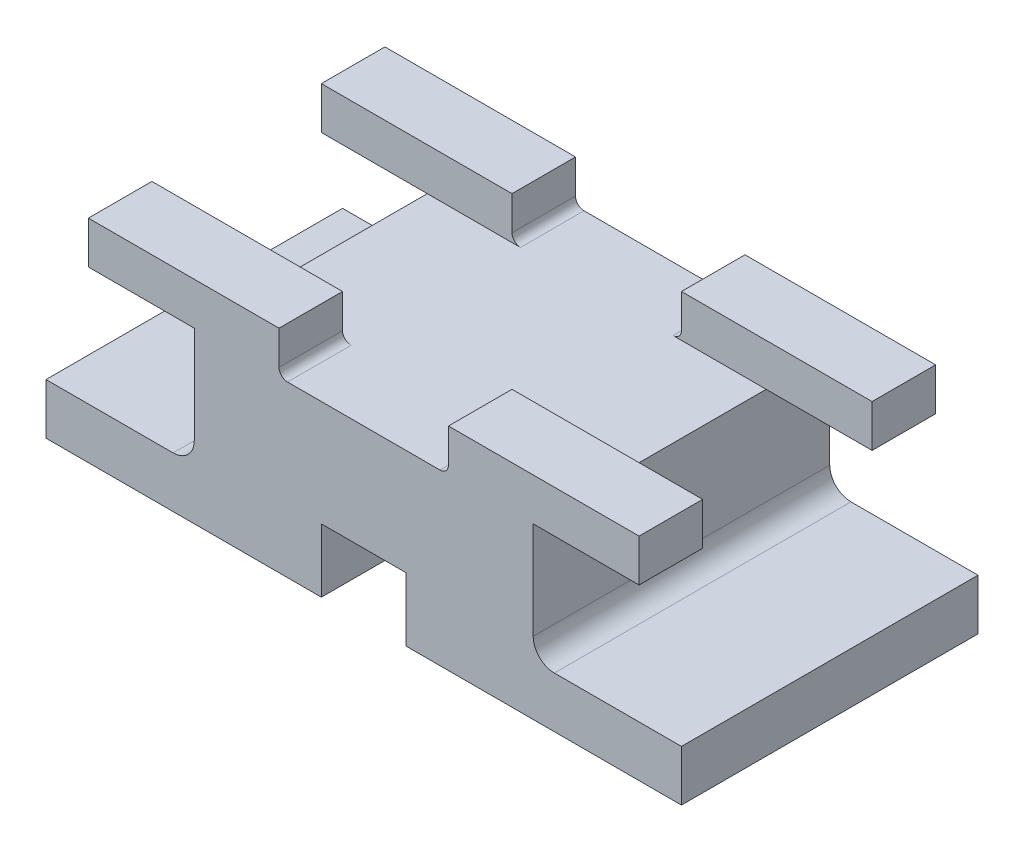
ISO-10303-21;
HEADER;
FILE_DESCRIPTION(('STEP AP214'),'2;1');
FILE_NAME('part.step','',(''),(''),'','','');
FILE_SCHEMA(('AUTOMOTIVE_DESIGN { 1 0 10303 214 1 1 1 1 }'));
ENDSEC;
DATA;
#1=APPLICATION_CONTEXT('core data for automotive mechanical design processes');
#2=APPLICATION_PROTOCOL_DEFINITION('international standard','automotive_design',2000,#1);
#3=PRODUCT_CONTEXT('',#1,'mechanical');
#4=PRODUCT('Part','Part','',(#3));
#5=PRODUCT_RELATED_PRODUCT_CATEGORY('part','',(#4));
#6=PRODUCT_DEFINITION_FORMATION('','',#4);
#7=PRODUCT_DEFINITION_CONTEXT('part definition',#1,'design');
#8=PRODUCT_DEFINITION('design','',#6,#7);
#9=PRODUCT_DEFINITION_SHAPE('','',#8);
#10=(LENGTH_UNIT() NAMED_UNIT(*) SI_UNIT(.MILLI.,.METRE.));
#11=(NAMED_UNIT(*) PLANE_ANGLE_UNIT() SI_UNIT($,.RADIAN.));
#12=(NAMED_UNIT(*) SI_UNIT($,.STERADIAN.) SOLID_ANGLE_UNIT());
#13=UNCERTAINTY_MEASURE_WITH_UNIT(LENGTH_MEASURE(1.E-05),#10,'distance_accuracy_value','');
#14=(GEOMETRIC_REPRESENTATION_CONTEXT(3) GLOBAL_UNCERTAINTY_ASSIGNED_CONTEXT((#13)) GLOBAL_UNIT_ASSIGNED_CONTEXT((#10,
#11,#12)) REPRESENTATION_CONTEXT('',''));
#15=CARTESIAN_POINT('',(0.,0.,0.));
#16=DIRECTION('',(0.,0.,1.));
#17=DIRECTION('',(1.,0.,0.));
#18=AXIS2_PLACEMENT_3D('',#15,#16,#17);
#19=CARTESIAN_POINT('',(40.,40.,35.));
#20=DIRECTION('',(0.,1.,0.));
#21=DIRECTION('',(0.,0.,1.));
#22=AXIS2_PLACEMENT_3D('',#19,#20,#21);
#23=PLANE('',#22);
#24=DIRECTION('',(0.,0.,-1.));
#25=VECTOR('',#24,1.);
#26=CARTESIAN_POINT('',(40.,40.,35.));
#27=LINE('',#26,#25);
#28=CARTESIAN_POINT('',(40.,40.,35.));
#29=VERTEX_POINT('',#28);
#30=CARTESIAN_POINT('',(40.,40.,20.));
#31=VERTEX_POINT('',#30);
#32=EDGE_CURVE('E305',#29,#31,#27,.T.);
#33=ORIENTED_EDGE('',*,*,#32,.T.);
#34=DIRECTION('',(-1.,0.,0.));
#35=VECTOR('',#34,1.);
#36=CARTESIAN_POINT('',(-65.,40.,20.));
#37=LINE('',#36,#35);
#38=CARTESIAN_POINT('',(65.,40.,20.));
#39=VERTEX_POINT('',#38);
#40=EDGE_CURVE('E590',#39,#31,#37,.T.);
#41=ORIENTED_EDGE('',*,*,#40,.F.);
#42=DIRECTION('',(0.,0.,-1.));
#43=VECTOR('',#42,1.);
#44=CARTESIAN_POINT('',(65.,40.,35.));
#45=LINE('',#44,#43);
#46=CARTESIAN_POINT('',(65.,40.,35.));
#47=VERTEX_POINT('',#46);
#48=EDGE_CURVE('E301',#47,#39,#45,.T.);
#49=ORIENTED_EDGE('',*,*,#48,.F.);
#50=DIRECTION('',(1.,0.,0.));
#51=VECTOR('',#50,1.);
#52=CARTESIAN_POINT('',(40.,40.,35.));
#53=LINE('',#52,#51);
#54=EDGE_CURVE('E506',#29,#47,#53,.T.);
#55=ORIENTED_EDGE('',*,*,#54,.F.);
#56=EDGE_LOOP('',(#33,#41,#49,#55));
#57=FACE_BOUND('',#56,.T.);
#58=ADVANCED_FACE('F33',(#57),#23,.F.);
#59=CARTESIAN_POINT('',(65.,40.,35.));
#60=DIRECTION('',(-1.,0.,0.));
#61=DIRECTION('',(0.,0.,1.));
#62=AXIS2_PLACEMENT_3D('',#59,#60,#61);
#63=PLANE('',#62);
#64=ORIENTED_EDGE('',*,*,#48,.T.);
#65=DIRECTION('',(0.,1.,0.));
#66=VECTOR('',#65,1.);
#67=CARTESIAN_POINT('',(65.,-96.0147050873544,20.));
#68=LINE('',#67,#66);
#69=CARTESIAN_POINT('',(65.,50.,20.));
#70=VERTEX_POINT('',#69);
#71=EDGE_CURVE('E578',#39,#70,#68,.T.);
#72=ORIENTED_EDGE('',*,*,#71,.T.);
#73=DIRECTION('',(0.,0.,-1.));
#74=VECTOR('',#73,1.);
#75=CARTESIAN_POINT('',(65.,50.,35.));
#76=LINE('',#75,#74);
#77=CARTESIAN_POINT('',(65.,50.,35.));
#78=VERTEX_POINT('',#77);
#79=EDGE_CURVE('E292',#78,#70,#76,.T.);
#80=ORIENTED_EDGE('',*,*,#79,.F.);
#81=DIRECTION('',(0.,1.,0.));
#82=VECTOR('',#81,1.);
#83=CARTESIAN_POINT('',(65.,40.,35.));
#84=LINE('',#83,#82);
#85=EDGE_CURVE('E508',#47,#78,#84,.T.);
#86=ORIENTED_EDGE('',*,*,#85,.F.);
#87=EDGE_LOOP('',(#64,#72,#80,#86));
#88=FACE_BOUND('',#87,.T.);
#89=ADVANCED_FACE('F629',(#88),#63,.F.);
#90=CARTESIAN_POINT('',(65.,50.,35.));
#91=DIRECTION('',(0.,-1.,0.));
#92=DIRECTION('',(1.,0.,0.));
#93=AXIS2_PLACEMENT_3D('',#90,#91,#92);
#94=PLANE('',#93);
#95=ORIENTED_EDGE('',*,*,#79,.T.);
#96=DIRECTION('',(1.,0.,0.));
#97=VECTOR('',#96,1.);
#98=CARTESIAN_POINT('',(-65.,50.,20.));
#99=LINE('',#98,#97);
#100=CARTESIAN_POINT('',(20.,50.,20.));
#101=VERTEX_POINT('',#100);
#102=EDGE_CURVE('E285',#101,#70,#99,.T.);
#103=ORIENTED_EDGE('',*,*,#102,.F.);
#104=DIRECTION('',(0.,0.,-1.));
#105=VECTOR('',#104,1.);
#106=CARTESIAN_POINT('',(20.,50.,35.));
#107=LINE('',#106,#105);
#108=CARTESIAN_POINT('',(20.,50.,35.));
#109=VERTEX_POINT('',#108);
#110=EDGE_CURVE('E293',#109,#101,#107,.T.);
#111=ORIENTED_EDGE('',*,*,#110,.F.);
#112=DIRECTION('',(-1.,0.,0.));
#113=VECTOR('',#112,1.);
#114=CARTESIAN_POINT('',(65.,50.,35.));
#115=LINE('',#114,#113);
#116=EDGE_CURVE('E510',#78,#109,#115,.T.);
#117=ORIENTED_EDGE('',*,*,#116,.F.);
#118=EDGE_LOOP('',(#95,#103,#111,#117));
#119=FACE_BOUND('',#118,.T.);
#120=ADVANCED_FACE('F635',(#119),#94,.F.);
#121=CARTESIAN_POINT('',(20.,50.,35.));
#122=DIRECTION('',(1.,0.,0.));
#123=DIRECTION('',(0.,1.,0.));
#124=AXIS2_PLACEMENT_3D('',#121,#122,#123);
#125=PLANE('',#124);
#126=ORIENTED_EDGE('',*,*,#110,.T.);
#127=DIRECTION('',(0.,-1.,0.));
#128=VECTOR('',#127,1.);
#129=CARTESIAN_POINT('',(20.,50.,20.));
#130=LINE('',#129,#128);
#131=CARTESIAN_POINT('',(20.,42.,20.));
#132=VERTEX_POINT('',#131);
#133=EDGE_CURVE('E486',#101,#132,#130,.T.);
#134=ORIENTED_EDGE('',*,*,#133,.T.);
#135=DIRECTION('',(0.,0.,-1.));
#136=VECTOR('',#135,1.);
#137=CARTESIAN_POINT('',(20.,42.,35.));
#138=LINE('',#137,#136);
#139=CARTESIAN_POINT('',(20.,42.,35.));
#140=VERTEX_POINT('',#139);
#141=EDGE_CURVE('E440',#140,#132,#138,.T.);
#142=ORIENTED_EDGE('',*,*,#141,.F.);
#143=DIRECTION('',(0.,-1.,0.));
#144=VECTOR('',#143,1.);
#145=CARTESIAN_POINT('',(20.,50.,35.));
#146=LINE('',#145,#144);
#147=EDGE_CURVE('E512',#109,#140,#146,.T.);
#148=ORIENTED_EDGE('',*,*,#147,.F.);
#149=EDGE_LOOP('',(#126,#134,#142,#148));
#150=FACE_BOUND('',#149,.T.);
#151=ADVANCED_FACE('F741',(#150),#125,.F.);
#152=CARTESIAN_POINT('',(18.,42.,35.));
#153=DIRECTION('',(0.,0.,-1.));
#154=DIRECTION('',(-1.,0.,0.));
#155=AXIS2_PLACEMENT_3D('',#152,#153,#154);
#156=CYLINDRICAL_SURFACE('',#155,2.);
#157=ORIENTED_EDGE('',*,*,#141,.T.);
#158=CARTESIAN_POINT('',(18.,42.,20.));
#159=DIRECTION('',(0.,0.,1.));
#160=DIRECTION('',(1.,0.,0.));
#161=AXIS2_PLACEMENT_3D('',#158,#159,#160);
#162=CIRCLE('',#161,2.);
#163=CARTESIAN_POINT('',(18.,40.,20.));
#164=VERTEX_POINT('',#163);
#165=EDGE_CURVE('E484',#132,#164,#162,.F.);
#166=ORIENTED_EDGE('',*,*,#165,.T.);
#167=DIRECTION('',(0.,0.,-1.));
#168=VECTOR('',#167,1.);
#169=CARTESIAN_POINT('',(18.,40.,35.));
#170=LINE('',#169,#168);
#171=CARTESIAN_POINT('',(18.,40.,35.));
#172=VERTEX_POINT('',#171);
#173=EDGE_CURVE('E437',#172,#164,#170,.T.);
#174=ORIENTED_EDGE('',*,*,#173,.F.);
#175=CARTESIAN_POINT('',(18.,42.,35.));
#176=DIRECTION('',(0.,0.,-1.));
#177=DIRECTION('',(-1.,0.,0.));
#178=AXIS2_PLACEMENT_3D('',#175,#176,#177);
#179=CIRCLE('',#178,2.);
#180=EDGE_CURVE('E514',#140,#172,#179,.T.);
#181=ORIENTED_EDGE('',*,*,#180,.F.);
#182=EDGE_LOOP('',(#157,#166,#174,#181));
#183=FACE_BOUND('',#182,.T.);
#184=ADVANCED_FACE('F751',(#183),#156,.F.);
#185=CARTESIAN_POINT('',(-18.,42.,35.));
#186=DIRECTION('',(0.,0.,-1.));
#187=DIRECTION('',(-1.,0.,0.));
#188=AXIS2_PLACEMENT_3D('',#185,#186,#187);
#189=CYLINDRICAL_SURFACE('',#188,2.);
#190=DIRECTION('',(0.,0.,-1.));
#191=VECTOR('',#190,1.);
#192=CARTESIAN_POINT('',(-18.,40.,35.));
#193=LINE('',#192,#191);
#194=CARTESIAN_POINT('',(-18.,40.,35.));
#195=VERTEX_POINT('',#194);
#196=CARTESIAN_POINT('',(-18.,40.,20.));
#197=VERTEX_POINT('',#196);
#198=EDGE_CURVE('E433',#195,#197,#193,.T.);
#199=ORIENTED_EDGE('',*,*,#198,.T.);
#200=CARTESIAN_POINT('',(-18.,42.,20.));
#201=DIRECTION('',(0.,0.,1.));
#202=DIRECTION('',(1.,0.,0.));
#203=AXIS2_PLACEMENT_3D('',#200,#201,#202);
#204=CIRCLE('',#203,2.);
#205=CARTESIAN_POINT('',(-20.,42.,20.));
#206=VERTEX_POINT('',#205);
#207=EDGE_CURVE('E481',#197,#206,#204,.F.);
#208=ORIENTED_EDGE('',*,*,#207,.T.);
#209=DIRECTION('',(0.,0.,-1.));
#210=VECTOR('',#209,1.);
#211=CARTESIAN_POINT('',(-20.,42.,35.));
#212=LINE('',#211,#210);
#213=CARTESIAN_POINT('',(-20.,42.,35.));
#214=VERTEX_POINT('',#213);
#215=EDGE_CURVE('E429',#214,#206,#212,.T.);
#216=ORIENTED_EDGE('',*,*,#215,.F.);
#217=CARTESIAN_POINT('',(-18.,42.,35.));
#218=DIRECTION('',(0.,0.,-1.));
#219=DIRECTION('',(1.,0.,0.));
#220=AXIS2_PLACEMENT_3D('',#217,#218,#219);
#221=CIRCLE('',#220,2.);
#222=EDGE_CURVE('E518',#195,#214,#221,.T.);
#223=ORIENTED_EDGE('',*,*,#222,.F.);
#224=EDGE_LOOP('',(#199,#208,#216,#223));
#225=FACE_BOUND('',#224,.T.);
#226=ADVANCED_FACE('F761',(#225),#189,.F.);
#227=CARTESIAN_POINT('',(-20.,50.,35.));
#228=DIRECTION('',(-1.,0.,0.));
#229=DIRECTION('',(0.,-1.,0.));
#230=AXIS2_PLACEMENT_3D('',#227,#228,#229);
#231=PLANE('',#230);
#232=ORIENTED_EDGE('',*,*,#215,.T.);
#233=DIRECTION('',(0.,1.,0.));
#234=VECTOR('',#233,1.);
#235=CARTESIAN_POINT('',(-20.,50.,20.));
#236=LINE('',#235,#234);
#237=CARTESIAN_POINT('',(-20.,50.,20.));
#238=VERTEX_POINT('',#237);
#239=EDGE_CURVE('E478',#206,#238,#236,.T.);
#240=ORIENTED_EDGE('',*,*,#239,.T.);
#241=DIRECTION('',(0.,0.,-1.));
#242=VECTOR('',#241,1.);
#243=CARTESIAN_POINT('',(-20.,50.,35.));
#244=LINE('',#243,#242);
#245=CARTESIAN_POINT('',(-20.,50.,35.));
#246=VERTEX_POINT('',#245);
#247=EDGE_CURVE('E425',#246,#238,#244,.T.);
#248=ORIENTED_EDGE('',*,*,#247,.F.);
#249=DIRECTION('',(0.,1.,0.));
#250=VECTOR('',#249,1.);
#251=CARTESIAN_POINT('',(-20.,50.,35.));
#252=LINE('',#251,#250);
#253=EDGE_CURVE('E520',#214,#246,#252,.T.);
#254=ORIENTED_EDGE('',*,*,#253,.F.);
#255=EDGE_LOOP('',(#232,#240,#248,#254));
#256=FACE_BOUND('',#255,.T.);
#257=ADVANCED_FACE('F770',(#256),#231,.F.);
#258=CARTESIAN_POINT('',(-65.,50.,35.));
#259=DIRECTION('',(0.,-1.,0.));
#260=DIRECTION('',(1.,0.,0.));
#261=AXIS2_PLACEMENT_3D('',#258,#259,#260);
#262=PLANE('',#261);
#263=ORIENTED_EDGE('',*,*,#247,.T.);
#264=CARTESIAN_POINT('',(-65.,50.,20.));
#265=VERTEX_POINT('',#264);
#266=EDGE_CURVE('E276',#265,#238,#99,.T.);
#267=ORIENTED_EDGE('',*,*,#266,.F.);
#268=DIRECTION('',(0.,0.,-1.));
#269=VECTOR('',#268,1.);
#270=CARTESIAN_POINT('',(-65.,50.,35.));
#271=LINE('',#270,#269);
#272=CARTESIAN_POINT('',(-65.,50.,35.));
#273=VERTEX_POINT('',#272);
#274=EDGE_CURVE('E421',#273,#265,#271,.T.);
#275=ORIENTED_EDGE('',*,*,#274,.F.);
#276=DIRECTION('',(-1.,0.,0.));
#277=VECTOR('',#276,1.);
#278=CARTESIAN_POINT('',(-65.,50.,35.));
#279=LINE('',#278,#277);
#280=EDGE_CURVE('E522',#246,#273,#279,.T.);
#281=ORIENTED_EDGE('',*,*,#280,.F.);
#282=EDGE_LOOP('',(#263,#267,#275,#281));
#283=FACE_BOUND('',#282,.T.);
#284=ADVANCED_FACE('F780',(#283),#262,.F.);
#285=CARTESIAN_POINT('',(-65.,40.,35.));
#286=DIRECTION('',(1.,0.,0.));
#287=DIRECTION('',(0.,0.,-1.));
#288=AXIS2_PLACEMENT_3D('',#285,#286,#287);
#289=PLANE('',#288);
#290=ORIENTED_EDGE('',*,*,#274,.T.);
#291=DIRECTION('',(0.,1.,0.));
#292=VECTOR('',#291,1.);
#293=CARTESIAN_POINT('',(-65.,-96.0147050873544,20.));
#294=LINE('',#293,#292);
#295=CARTESIAN_POINT('',(-65.,40.,20.));
#296=VERTEX_POINT('',#295);
#297=EDGE_CURVE('E576',#296,#265,#294,.T.);
#298=ORIENTED_EDGE('',*,*,#297,.F.);
#299=DIRECTION('',(0.,0.,-1.));
#300=VECTOR('',#299,1.);
#301=CARTESIAN_POINT('',(-65.,40.,35.));
#302=LINE('',#301,#300);
#303=CARTESIAN_POINT('',(-65.,40.,35.));
#304=VERTEX_POINT('',#303);
#305=EDGE_CURVE('E417',#304,#296,#302,.T.);
#306=ORIENTED_EDGE('',*,*,#305,.F.);
#307=DIRECTION('',(0.,-1.,0.));
#308=VECTOR('',#307,1.);
#309=CARTESIAN_POINT('',(-65.,40.,35.));
#310=LINE('',#309,#308);
#311=EDGE_CURVE('E524',#273,#304,#310,.T.);
#312=ORIENTED_EDGE('',*,*,#311,.F.);
#313=EDGE_LOOP('',(#290,#298,#306,#312));
#314=FACE_BOUND('',#313,.T.);
#315=ADVANCED_FACE('F790',(#314),#289,.F.);
#316=CARTESIAN_POINT('',(-40.,40.,35.));
#317=DIRECTION('',(0.,1.,0.));
#318=DIRECTION('',(0.,0.,1.));
#319=AXIS2_PLACEMENT_3D('',#316,#317,#318);
#320=PLANE('',#319);
#321=ORIENTED_EDGE('',*,*,#305,.T.);
#322=CARTESIAN_POINT('',(-40.,40.,20.));
#323=VERTEX_POINT('',#322);
#324=EDGE_CURVE('E937',#323,#296,#37,.T.);
#325=ORIENTED_EDGE('',*,*,#324,.F.);
#326=DIRECTION('',(0.,0.,-1.));
#327=VECTOR('',#326,1.);
#328=CARTESIAN_POINT('',(-40.,40.,35.));
#329=LINE('',#328,#327);
#330=CARTESIAN_POINT('',(-40.,40.,35.));
#331=VERTEX_POINT('',#330);
#332=EDGE_CURVE('E412',#331,#323,#329,.T.);
#333=ORIENTED_EDGE('',*,*,#332,.F.);
#334=DIRECTION('',(1.,0.,0.));
#335=VECTOR('',#334,1.);
#336=CARTESIAN_POINT('',(-40.,40.,35.));
#337=LINE('',#336,#335);
#338=EDGE_CURVE('E526',#304,#331,#337,.T.);
#339=ORIENTED_EDGE('',*,*,#338,.F.);
#340=EDGE_LOOP('',(#321,#325,#333,#339));
#341=FACE_BOUND('',#340,.T.);
#342=ADVANCED_FACE('F627',(#341),#320,.F.);
#343=CARTESIAN_POINT('',(-75.,0.,35.));
#344=DIRECTION('',(0.,1.,0.));
#345=DIRECTION('',(0.,0.,1.));
#346=AXIS2_PLACEMENT_3D('',#343,#344,#345);
#347=PLANE('',#346);
#348=DIRECTION('',(1.,0.,0.));
#349=VECTOR('',#348,1.);
#350=CARTESIAN_POINT('',(-75.,0.,-35.));
#351=LINE('',#350,#349);
#352=CARTESIAN_POINT('',(-75.,0.,-35.));
#353=VERTEX_POINT('',#352);
#354=CARTESIAN_POINT('',(-10.,0.,-35.));
#355=VERTEX_POINT('',#354);
#356=EDGE_CURVE('E345',#353,#355,#351,.T.);
#357=ORIENTED_EDGE('',*,*,#356,.T.);
#358=DIRECTION('',(0.,0.,-1.));
#359=VECTOR('',#358,1.);
#360=CARTESIAN_POINT('',(-10.,0.,35.));
#361=LINE('',#360,#359);
#362=CARTESIAN_POINT('',(-10.,0.,35.));
#363=VERTEX_POINT('',#362);
#364=EDGE_CURVE('E11',#363,#355,#361,.T.);
#365=ORIENTED_EDGE('',*,*,#364,.F.);
#366=DIRECTION('',(1.,0.,0.));
#367=VECTOR('',#366,1.);
#368=CARTESIAN_POINT('',(-75.,0.,35.));
#369=LINE('',#368,#367);
#370=CARTESIAN_POINT('',(-75.,0.,35.));
#371=VERTEX_POINT('',#370);
#372=EDGE_CURVE('E397',#371,#363,#369,.T.);
#373=ORIENTED_EDGE('',*,*,#372,.F.);
#374=DIRECTION('',(0.,0.,-1.));
#375=VECTOR('',#374,1.);
#376=CARTESIAN_POINT('',(-75.,0.,35.));
#377=LINE('',#376,#375);
#378=EDGE_CURVE('E398',#371,#353,#377,.T.);
#379=ORIENTED_EDGE('',*,*,#378,.T.);
#380=EDGE_LOOP('',(#357,#365,#373,#379));
#381=FACE_BOUND('',#380,.T.);
#382=ADVANCED_FACE('F35',(#381),#347,.F.);
#383=CARTESIAN_POINT('',(-10.,0.,35.));
#384=DIRECTION('',(-1.,0.,0.));
#385=DIRECTION('',(0.,0.,1.));
#386=AXIS2_PLACEMENT_3D('',#383,#384,#385);
#387=PLANE('',#386);
#388=DIRECTION('',(0.,1.,0.));
#389=VECTOR('',#388,1.);
#390=CARTESIAN_POINT('',(-10.,0.,-35.));
#391=LINE('',#390,#389);
#392=CARTESIAN_POINT('',(-10.,15.,-35.));
#393=VERTEX_POINT('',#392);
#394=EDGE_CURVE('E339',#355,#393,#391,.T.);
#395=ORIENTED_EDGE('',*,*,#394,.T.);
#396=DIRECTION('',(0.,0.,-1.));
#397=VECTOR('',#396,1.);
#398=CARTESIAN_POINT('',(-10.,15.,35.));
#399=LINE('',#398,#397);
#400=CARTESIAN_POINT('',(-10.,15.,35.));
#401=VERTEX_POINT('',#400);
#402=EDGE_CURVE('E41',#401,#393,#399,.T.);
#403=ORIENTED_EDGE('',*,*,#402,.F.);
#404=DIRECTION('',(0.,1.,0.));
#405=VECTOR('',#404,1.);
#406=CARTESIAN_POINT('',(-10.,0.,35.));
#407=LINE('',#406,#405);
#408=EDGE_CURVE('E491',#363,#401,#407,.T.);
#409=ORIENTED_EDGE('',*,*,#408,.F.);
#410=ORIENTED_EDGE('',*,*,#364,.T.);
#411=EDGE_LOOP('',(#395,#403,#409,#410));
#412=FACE_BOUND('',#411,.T.);
#413=ADVANCED_FACE('F620',(#412),#387,.F.);
#414=CARTESIAN_POINT('',(-10.,15.,35.));
#415=DIRECTION('',(0.,1.,0.));
#416=DIRECTION('',(0.,0.,1.));
#417=AXIS2_PLACEMENT_3D('',#414,#415,#416);
#418=PLANE('',#417);
#419=DIRECTION('',(1.,0.,0.));
#420=VECTOR('',#419,1.);
#421=CARTESIAN_POINT('',(-10.,15.,-35.));
#422=LINE('',#421,#420);
#423=CARTESIAN_POINT('',(10.,15.,-35.));
#424=VERTEX_POINT('',#423);
#425=EDGE_CURVE('E332',#393,#424,#422,.T.);
#426=ORIENTED_EDGE('',*,*,#425,.T.);
#427=DIRECTION('',(0.,0.,-1.));
#428=VECTOR('',#427,1.);
#429=CARTESIAN_POINT('',(10.,15.,35.));
#430=LINE('',#429,#428);
#431=CARTESIAN_POINT('',(10.,15.,35.));
#432=VERTEX_POINT('',#431);
#433=EDGE_CURVE('E323',#432,#424,#430,.T.);
#434=ORIENTED_EDGE('',*,*,#433,.F.);
#435=DIRECTION('',(1.,0.,0.));
#436=VECTOR('',#435,1.);
#437=CARTESIAN_POINT('',(-10.,15.,35.));
#438=LINE('',#437,#436);
#439=EDGE_CURVE('E333',#401,#432,#438,.T.);
#440=ORIENTED_EDGE('',*,*,#439,.F.);
#441=ORIENTED_EDGE('',*,*,#402,.T.);
#442=EDGE_LOOP('',(#426,#434,#440,#441));
#443=FACE_BOUND('',#442,.T.);
#444=ADVANCED_FACE('F330',(#443),#418,.F.);
#445=CARTESIAN_POINT('',(10.,0.,35.));
#446=DIRECTION('',(1.,0.,0.));
#447=DIRECTION('',(0.,0.,-1.));
#448=AXIS2_PLACEMENT_3D('',#445,#446,#447);
#449=PLANE('',#448);
#450=DIRECTION('',(0.,-1.,0.));
#451=VECTOR('',#450,1.);
#452=CARTESIAN_POINT('',(10.,0.,-35.));
#453=LINE('',#452,#451);
#454=CARTESIAN_POINT('',(10.,0.,-35.));
#455=VERTEX_POINT('',#454);
#456=EDGE_CURVE('E341',#424,#455,#453,.T.);
#457=ORIENTED_EDGE('',*,*,#456,.T.);
#458=DIRECTION('',(0.,0.,-1.));
#459=VECTOR('',#458,1.);
#460=CARTESIAN_POINT('',(10.,0.,35.));
#461=LINE('',#460,#459);
#462=CARTESIAN_POINT('',(10.,0.,35.));
#463=VERTEX_POINT('',#462);
#464=EDGE_CURVE('E320',#463,#455,#461,.T.);
#465=ORIENTED_EDGE('',*,*,#464,.F.);
#466=DIRECTION('',(0.,-1.,0.));
#467=VECTOR('',#466,1.);
#468=CARTESIAN_POINT('',(10.,0.,35.));
#469=LINE('',#468,#467);
#470=EDGE_CURVE('E494',#432,#463,#469,.T.);
#471=ORIENTED_EDGE('',*,*,#470,.F.);
#472=ORIENTED_EDGE('',*,*,#433,.T.);
#473=EDGE_LOOP('',(#457,#465,#471,#472));
#474=FACE_BOUND('',#473,.T.);
#475=ADVANCED_FACE('F617',(#474),#449,.F.);
#476=CARTESIAN_POINT('',(75.,0.,35.));
#477=DIRECTION('',(0.,1.,0.));
#478=DIRECTION('',(0.,0.,1.));
#479=AXIS2_PLACEMENT_3D('',#476,#477,#478);
#480=PLANE('',#479);
#481=DIRECTION('',(1.,0.,0.));
#482=VECTOR('',#481,1.);
#483=CARTESIAN_POINT('',(75.,0.,-35.));
#484=LINE('',#483,#482);
#485=CARTESIAN_POINT('',(75.,0.,-35.));
#486=VERTEX_POINT('',#485);
#487=EDGE_CURVE('E343',#455,#486,#484,.T.);
#488=ORIENTED_EDGE('',*,*,#487,.T.);
#489=DIRECTION('',(0.,0.,-1.));
#490=VECTOR('',#489,1.);
#491=CARTESIAN_POINT('',(75.,0.,35.));
#492=LINE('',#491,#490);
#493=CARTESIAN_POINT('',(75.,0.,35.));
#494=VERTEX_POINT('',#493);
#495=EDGE_CURVE('E317',#494,#486,#492,.T.);
#496=ORIENTED_EDGE('',*,*,#495,.F.);
#497=DIRECTION('',(1.,0.,0.));
#498=VECTOR('',#497,1.);
#499=CARTESIAN_POINT('',(75.,0.,35.));
#500=LINE('',#499,#498);
#501=EDGE_CURVE('E496',#463,#494,#500,.T.);
#502=ORIENTED_EDGE('',*,*,#501,.F.);
#503=ORIENTED_EDGE('',*,*,#464,.T.);
#504=EDGE_LOOP('',(#488,#496,#502,#503));
#505=FACE_BOUND('',#504,.T.);
#506=ADVANCED_FACE('F612',(#505),#480,.F.);
#507=CARTESIAN_POINT('',(75.,0.,35.));
#508=DIRECTION('',(-1.,0.,0.));
#509=DIRECTION('',(0.,0.,1.));
#510=AXIS2_PLACEMENT_3D('',#507,#508,#509);
#511=PLANE('',#510);
#512=DIRECTION('',(0.,1.,0.));
#513=VECTOR('',#512,1.);
#514=CARTESIAN_POINT('',(75.,0.,-35.));
#515=LINE('',#514,#513);
#516=CARTESIAN_POINT('',(75.,12.,-35.));
#517=VERTEX_POINT('',#516);
#518=EDGE_CURVE('E350',#486,#517,#515,.T.);
#519=ORIENTED_EDGE('',*,*,#518,.T.);
#520=DIRECTION('',(0.,0.,-1.));
#521=VECTOR('',#520,1.);
#522=CARTESIAN_POINT('',(75.,12.,35.));
#523=LINE('',#522,#521);
#524=CARTESIAN_POINT('',(75.,12.,35.));
#525=VERTEX_POINT('',#524);
#526=EDGE_CURVE('E314',#525,#517,#523,.T.);
#527=ORIENTED_EDGE('',*,*,#526,.F.);
#528=DIRECTION('',(0.,1.,0.));
#529=VECTOR('',#528,1.);
#530=CARTESIAN_POINT('',(75.,0.,35.));
#531=LINE('',#530,#529);
#532=EDGE_CURVE('E498',#494,#525,#531,.T.);
#533=ORIENTED_EDGE('',*,*,#532,.F.);
#534=ORIENTED_EDGE('',*,*,#495,.T.);
#535=EDGE_LOOP('',(#519,#527,#533,#534));
#536=FACE_BOUND('',#535,.T.);
#537=ADVANCED_FACE('F609',(#536),#511,.F.);
#538=CARTESIAN_POINT('',(75.,12.,35.));
#539=DIRECTION('',(0.,-1.,0.));
#540=DIRECTION('',(0.,0.,-1.));
#541=AXIS2_PLACEMENT_3D('',#538,#539,#540);
#542=PLANE('',#541);
#543=DIRECTION('',(-1.,0.,0.));
#544=VECTOR('',#543,1.);
#545=CARTESIAN_POINT('',(75.,12.,-35.));
#546=LINE('',#545,#544);
#547=CARTESIAN_POINT('',(45.,12.,-35.));
#548=VERTEX_POINT('',#547);
#549=EDGE_CURVE('E352',#517,#548,#546,.T.);
#550=ORIENTED_EDGE('',*,*,#549,.T.);
#551=DIRECTION('',(0.,0.,-1.));
#552=VECTOR('',#551,1.);
#553=CARTESIAN_POINT('',(45.,12.,35.));
#554=LINE('',#553,#552);
#555=CARTESIAN_POINT('',(45.,12.,35.));
#556=VERTEX_POINT('',#555);
#557=EDGE_CURVE('E311',#556,#548,#554,.T.);
#558=ORIENTED_EDGE('',*,*,#557,.F.);
#559=DIRECTION('',(-1.,0.,0.));
#560=VECTOR('',#559,1.);
#561=CARTESIAN_POINT('',(75.,12.,35.));
#562=LINE('',#561,#560);
#563=EDGE_CURVE('E500',#525,#556,#562,.T.);
#564=ORIENTED_EDGE('',*,*,#563,.F.);
#565=ORIENTED_EDGE('',*,*,#526,.T.);
#566=EDGE_LOOP('',(#550,#558,#564,#565));
#567=FACE_BOUND('',#566,.T.);
#568=ADVANCED_FACE('F605',(#567),#542,.F.);
#569=CARTESIAN_POINT('',(45.,17.,35.));
#570=DIRECTION('',(0.,0.,-1.));
#571=DIRECTION('',(-1.,0.,0.));
#572=AXIS2_PLACEMENT_3D('',#569,#570,#571);
#573=CYLINDRICAL_SURFACE('',#572,5.);
#574=CARTESIAN_POINT('',(45.,17.,-35.));
#575=DIRECTION('',(0.,0.,-1.));
#576=DIRECTION('',(1.,0.,0.));
#577=AXIS2_PLACEMENT_3D('',#574,#575,#576);
#578=CIRCLE('',#577,5.);
#579=CARTESIAN_POINT('',(40.,17.,-35.));
#580=VERTEX_POINT('',#579);
#581=EDGE_CURVE('E354',#548,#580,#578,.T.);
#582=ORIENTED_EDGE('',*,*,#581,.T.);
#583=DIRECTION('',(0.,0.,-1.));
#584=VECTOR('',#583,1.);
#585=CARTESIAN_POINT('',(40.,17.,35.));
#586=LINE('',#585,#584);
#587=CARTESIAN_POINT('',(40.,17.,35.));
#588=VERTEX_POINT('',#587);
#589=EDGE_CURVE('E308',#588,#580,#586,.T.);
#590=ORIENTED_EDGE('',*,*,#589,.F.);
#591=CARTESIAN_POINT('',(45.,17.,35.));
#592=DIRECTION('',(0.,0.,-1.));
#593=DIRECTION('',(1.,0.,0.));
#594=AXIS2_PLACEMENT_3D('',#591,#592,#593);
#595=CIRCLE('',#594,5.);
#596=EDGE_CURVE('E502',#556,#588,#595,.T.);
#597=ORIENTED_EDGE('',*,*,#596,.F.);
#598=ORIENTED_EDGE('',*,*,#557,.T.);
#599=EDGE_LOOP('',(#582,#590,#597,#598));
#600=FACE_BOUND('',#599,.T.);
#601=ADVANCED_FACE('F600',(#600),#573,.F.);
#602=CARTESIAN_POINT('',(40.,17.,35.));
#603=DIRECTION('',(-1.,0.,0.));
#604=DIRECTION('',(0.,0.,1.));
#605=AXIS2_PLACEMENT_3D('',#602,#603,#604);
#606=PLANE('',#605);
#607=DIRECTION('',(0.,1.,0.));
#608=VECTOR('',#607,1.);
#609=CARTESIAN_POINT('',(40.,17.,-35.));
#610=LINE('',#609,#608);
#611=CARTESIAN_POINT('',(40.,40.,-35.));
#612=VERTEX_POINT('',#611);
#613=EDGE_CURVE('E356',#580,#612,#610,.T.);
#614=ORIENTED_EDGE('',*,*,#613,.T.);
#615=CARTESIAN_POINT('',(40.,40.,-20.));
#616=VERTEX_POINT('',#615);
#617=EDGE_CURVE('E304',#616,#612,#27,.T.);
#618=ORIENTED_EDGE('',*,*,#617,.F.);
#619=DIRECTION('',(0.,0.,-1.));
#620=VECTOR('',#619,1.);
#621=CARTESIAN_POINT('',(40.,40.,35.));
#622=LINE('',#621,#620);
#623=EDGE_CURVE('E473',#31,#616,#622,.T.);
#624=ORIENTED_EDGE('',*,*,#623,.F.);
#625=ORIENTED_EDGE('',*,*,#32,.F.);
#626=DIRECTION('',(0.,1.,0.));
#627=VECTOR('',#626,1.);
#628=CARTESIAN_POINT('',(40.,17.,35.));
#629=LINE('',#628,#627);
#630=EDGE_CURVE('E504',#588,#29,#629,.T.);
#631=ORIENTED_EDGE('',*,*,#630,.F.);
#632=ORIENTED_EDGE('',*,*,#589,.T.);
#633=EDGE_LOOP('',(#614,#618,#624,#625,#631,#632));
#634=FACE_BOUND('',#633,.T.);
#635=ADVANCED_FACE('F591',(#634),#606,.F.);
#636=CARTESIAN_POINT('',(65.,40.,-20.));
#637=VERTEX_POINT('',#636);
#638=CARTESIAN_POINT('',(65.,40.,-35.));
#639=VERTEX_POINT('',#638);
#640=EDGE_CURVE('E296',#637,#639,#45,.T.);
#641=ORIENTED_EDGE('',*,*,#640,.F.);
#642=DIRECTION('',(1.,0.,0.));
#643=VECTOR('',#642,1.);
#644=CARTESIAN_POINT('',(-65.,40.,-20.));
#645=LINE('',#644,#643);
#646=EDGE_CURVE('E271',#616,#637,#645,.T.);
#647=ORIENTED_EDGE('',*,*,#646,.F.);
#648=ORIENTED_EDGE('',*,*,#617,.T.);
#649=DIRECTION('',(1.,0.,0.));
#650=VECTOR('',#649,1.);
#651=CARTESIAN_POINT('',(40.,40.,-35.));
#652=LINE('',#651,#650);
#653=EDGE_CURVE('E359',#612,#639,#652,.T.);
#654=ORIENTED_EDGE('',*,*,#653,.T.);
#655=EDGE_LOOP('',(#641,#647,#648,#654));
#656=FACE_BOUND('',#655,.T.);
#657=ADVANCED_FACE('F589',(#656),#23,.F.);
#658=CARTESIAN_POINT('',(65.,50.,-20.));
#659=VERTEX_POINT('',#658);
#660=CARTESIAN_POINT('',(65.,50.,-35.));
#661=VERTEX_POINT('',#660);
#662=EDGE_CURVE('E282',#659,#661,#76,.T.);
#663=ORIENTED_EDGE('',*,*,#662,.F.);
#664=DIRECTION('',(0.,1.,0.));
#665=VECTOR('',#664,1.);
#666=CARTESIAN_POINT('',(65.,-96.0147050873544,-20.));
#667=LINE('',#666,#665);
#668=EDGE_CURVE('E265',#637,#659,#667,.T.);
#669=ORIENTED_EDGE('',*,*,#668,.F.);
#670=ORIENTED_EDGE('',*,*,#640,.T.);
#671=DIRECTION('',(0.,1.,0.));
#672=VECTOR('',#671,1.);
#673=CARTESIAN_POINT('',(65.,40.,-35.));
#674=LINE('',#673,#672);
#675=EDGE_CURVE('E290',#639,#661,#674,.T.);
#676=ORIENTED_EDGE('',*,*,#675,.T.);
#677=EDGE_LOOP('',(#663,#669,#670,#676));
#678=FACE_BOUND('',#677,.T.);
#679=ADVANCED_FACE('F288',(#678),#63,.F.);
#680=CARTESIAN_POINT('',(20.,50.,-20.));
#681=VERTEX_POINT('',#680);
#682=CARTESIAN_POINT('',(20.,50.,-35.));
#683=VERTEX_POINT('',#682);
#684=EDGE_CURVE('E284',#681,#683,#107,.T.);
#685=ORIENTED_EDGE('',*,*,#684,.F.);
#686=DIRECTION('',(-1.,0.,0.));
#687=VECTOR('',#686,1.);
#688=CARTESIAN_POINT('',(-65.,50.,-20.));
#689=LINE('',#688,#687);
#690=EDGE_CURVE('E268',#659,#681,#689,.T.);
#691=ORIENTED_EDGE('',*,*,#690,.F.);
#692=ORIENTED_EDGE('',*,*,#662,.T.);
#693=DIRECTION('',(-1.,0.,0.));
#694=VECTOR('',#693,1.);
#695=CARTESIAN_POINT('',(65.,50.,-35.));
#696=LINE('',#695,#694);
#697=EDGE_CURVE('E363',#661,#683,#696,.T.);
#698=ORIENTED_EDGE('',*,*,#697,.T.);
#699=EDGE_LOOP('',(#685,#691,#692,#698));
#700=FACE_BOUND('',#699,.T.);
#701=ADVANCED_FACE('F280',(#700),#94,.F.);
#702=CARTESIAN_POINT('',(20.,42.,-20.));
#703=VERTEX_POINT('',#702);
#704=CARTESIAN_POINT('',(20.,42.,-35.));
#705=VERTEX_POINT('',#704);
#706=EDGE_CURVE('E439',#703,#705,#138,.T.);
#707=ORIENTED_EDGE('',*,*,#706,.F.);
#708=DIRECTION('',(0.,1.,0.));
#709=VECTOR('',#708,1.);
#710=CARTESIAN_POINT('',(20.,50.,-20.));
#711=LINE('',#710,#709);
#712=EDGE_CURVE('E471',#703,#681,#711,.T.);
#713=ORIENTED_EDGE('',*,*,#712,.T.);
#714=ORIENTED_EDGE('',*,*,#684,.T.);
#715=DIRECTION('',(0.,-1.,0.));
#716=VECTOR('',#715,1.);
#717=CARTESIAN_POINT('',(20.,50.,-35.));
#718=LINE('',#717,#716);
#719=EDGE_CURVE('E365',#683,#705,#718,.T.);
#720=ORIENTED_EDGE('',*,*,#719,.T.);
#721=EDGE_LOOP('',(#707,#713,#714,#720));
#722=FACE_BOUND('',#721,.T.);
#723=ADVANCED_FACE('F456',(#722),#125,.F.);
#724=CARTESIAN_POINT('',(18.,40.,-20.));
#725=VERTEX_POINT('',#724);
#726=CARTESIAN_POINT('',(18.,40.,-35.));
#727=VERTEX_POINT('',#726);
#728=EDGE_CURVE('E436',#725,#727,#170,.T.);
#729=ORIENTED_EDGE('',*,*,#728,.F.);
#730=CARTESIAN_POINT('',(18.,42.,-20.));
#731=DIRECTION('',(0.,0.,-1.));
#732=DIRECTION('',(-1.,0.,0.));
#733=AXIS2_PLACEMENT_3D('',#730,#731,#732);
#734=CIRCLE('',#733,2.);
#735=EDGE_CURVE('E453',#725,#703,#734,.F.);
#736=ORIENTED_EDGE('',*,*,#735,.T.);
#737=ORIENTED_EDGE('',*,*,#706,.T.);
#738=CARTESIAN_POINT('',(18.,42.,-35.));
#739=DIRECTION('',(0.,0.,-1.));
#740=DIRECTION('',(-1.,0.,0.));
#741=AXIS2_PLACEMENT_3D('',#738,#739,#740);
#742=CIRCLE('',#741,2.);
#743=EDGE_CURVE('E368',#705,#727,#742,.T.);
#744=ORIENTED_EDGE('',*,*,#743,.T.);
#745=EDGE_LOOP('',(#729,#736,#737,#744));
#746=FACE_BOUND('',#745,.T.);
#747=ADVANCED_FACE('F450',(#746),#156,.F.);
#748=CARTESIAN_POINT('',(-18.,40.,35.));
#749=DIRECTION('',(0.,-1.,0.));
#750=DIRECTION('',(0.,0.,-1.));
#751=AXIS2_PLACEMENT_3D('',#748,#749,#750);
#752=PLANE('',#751);
#753=CARTESIAN_POINT('',(-18.,40.,-20.));
#754=VERTEX_POINT('',#753);
#755=CARTESIAN_POINT('',(-18.,40.,-35.));
#756=VERTEX_POINT('',#755);
#757=EDGE_CURVE('E432',#754,#756,#193,.T.);
#758=ORIENTED_EDGE('',*,*,#757,.F.);
#759=CARTESIAN_POINT('',(-40.,40.,-20.));
#760=VERTEX_POINT('',#759);
#761=EDGE_CURVE('E461',#760,#754,#645,.T.);
#762=ORIENTED_EDGE('',*,*,#761,.F.);
#763=EDGE_CURVE('E416',#323,#760,#329,.T.);
#764=ORIENTED_EDGE('',*,*,#763,.F.);
#765=EDGE_CURVE('E941',#197,#323,#37,.T.);
#766=ORIENTED_EDGE('',*,*,#765,.F.);
#767=ORIENTED_EDGE('',*,*,#198,.F.);
#768=DIRECTION('',(-1.,0.,0.));
#769=VECTOR('',#768,1.);
#770=CARTESIAN_POINT('',(-18.,40.,35.));
#771=LINE('',#770,#769);
#772=EDGE_CURVE('E516',#172,#195,#771,.T.);
#773=ORIENTED_EDGE('',*,*,#772,.F.);
#774=ORIENTED_EDGE('',*,*,#173,.T.);
#775=EDGE_CURVE('E583',#31,#164,#37,.T.);
#776=ORIENTED_EDGE('',*,*,#775,.F.);
#777=ORIENTED_EDGE('',*,*,#623,.T.);
#778=EDGE_CURVE('E48',#725,#616,#645,.T.);
#779=ORIENTED_EDGE('',*,*,#778,.F.);
#780=ORIENTED_EDGE('',*,*,#728,.T.);
#781=DIRECTION('',(-1.,0.,0.));
#782=VECTOR('',#781,1.);
#783=CARTESIAN_POINT('',(-18.,40.,-35.));
#784=LINE('',#783,#782);
#785=EDGE_CURVE('E371',#727,#756,#784,.T.);
#786=ORIENTED_EDGE('',*,*,#785,.T.);
#787=EDGE_LOOP('',(#758,#762,#764,#766,#767,#773,#774,#776,#777,#779,#780,#786));
#788=FACE_BOUND('',#787,.T.);
#789=ADVANCED_FACE('F460',(#788),#752,.F.);
#790=CARTESIAN_POINT('',(-20.,42.,-20.));
#791=VERTEX_POINT('',#790);
#792=CARTESIAN_POINT('',(-20.,42.,-35.));
#793=VERTEX_POINT('',#792);
#794=EDGE_CURVE('E428',#791,#793,#212,.T.);
#795=ORIENTED_EDGE('',*,*,#794,.F.);
#796=CARTESIAN_POINT('',(-18.,42.,-20.));
#797=DIRECTION('',(0.,0.,-1.));
#798=DIRECTION('',(-1.,0.,0.));
#799=AXIS2_PLACEMENT_3D('',#796,#797,#798);
#800=CIRCLE('',#799,2.);
#801=EDGE_CURVE('E467',#791,#754,#800,.F.);
#802=ORIENTED_EDGE('',*,*,#801,.T.);
#803=ORIENTED_EDGE('',*,*,#757,.T.);
#804=CARTESIAN_POINT('',(-18.,42.,-35.));
#805=DIRECTION('',(0.,0.,-1.));
#806=DIRECTION('',(1.,0.,0.));
#807=AXIS2_PLACEMENT_3D('',#804,#805,#806);
#808=CIRCLE('',#807,2.);
#809=EDGE_CURVE('E374',#756,#793,#808,.T.);
#810=ORIENTED_EDGE('',*,*,#809,.T.);
#811=EDGE_LOOP('',(#795,#802,#803,#810));
#812=FACE_BOUND('',#811,.T.);
#813=ADVANCED_FACE('F466',(#812),#189,.F.);
#814=CARTESIAN_POINT('',(-20.,50.,-20.));
#815=VERTEX_POINT('',#814);
#816=CARTESIAN_POINT('',(-20.,50.,-35.));
#817=VERTEX_POINT('',#816);
#818=EDGE_CURVE('E424',#815,#817,#244,.T.);
#819=ORIENTED_EDGE('',*,*,#818,.F.);
#820=DIRECTION('',(0.,-1.,0.));
#821=VECTOR('',#820,1.);
#822=CARTESIAN_POINT('',(-20.,50.,-20.));
#823=LINE('',#822,#821);
#824=EDGE_CURVE('E469',#815,#791,#823,.T.);
#825=ORIENTED_EDGE('',*,*,#824,.T.);
#826=ORIENTED_EDGE('',*,*,#794,.T.);
#827=DIRECTION('',(0.,1.,0.));
#828=VECTOR('',#827,1.);
#829=CARTESIAN_POINT('',(-20.,50.,-35.));
#830=LINE('',#829,#828);
#831=EDGE_CURVE('E377',#793,#817,#830,.T.);
#832=ORIENTED_EDGE('',*,*,#831,.T.);
#833=EDGE_LOOP('',(#819,#825,#826,#832));
#834=FACE_BOUND('',#833,.T.);
#835=ADVANCED_FACE('F574',(#834),#231,.F.);
#836=CARTESIAN_POINT('',(-65.,50.,-20.));
#837=VERTEX_POINT('',#836);
#838=CARTESIAN_POINT('',(-65.,50.,-35.));
#839=VERTEX_POINT('',#838);
#840=EDGE_CURVE('E420',#837,#839,#271,.T.);
#841=ORIENTED_EDGE('',*,*,#840,.F.);
#842=EDGE_CURVE('E286',#815,#837,#689,.T.);
#843=ORIENTED_EDGE('',*,*,#842,.F.);
#844=ORIENTED_EDGE('',*,*,#818,.T.);
#845=DIRECTION('',(-1.,0.,0.));
#846=VECTOR('',#845,1.);
#847=CARTESIAN_POINT('',(-65.,50.,-35.));
#848=LINE('',#847,#846);
#849=EDGE_CURVE('E380',#817,#839,#848,.T.);
#850=ORIENTED_EDGE('',*,*,#849,.T.);
#851=EDGE_LOOP('',(#841,#843,#844,#850));
#852=FACE_BOUND('',#851,.T.);
#853=ADVANCED_FACE('F570',(#852),#262,.F.);
#854=CARTESIAN_POINT('',(-65.,40.,-20.));
#855=VERTEX_POINT('',#854);
#856=CARTESIAN_POINT('',(-65.,40.,-35.));
#857=VERTEX_POINT('',#856);
#858=EDGE_CURVE('E415',#855,#857,#302,.T.);
#859=ORIENTED_EDGE('',*,*,#858,.F.);
#860=DIRECTION('',(0.,1.,0.));
#861=VECTOR('',#860,1.);
#862=CARTESIAN_POINT('',(-65.,-96.0147050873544,-20.));
#863=LINE('',#862,#861);
#864=EDGE_CURVE('E275',#855,#837,#863,.T.);
#865=ORIENTED_EDGE('',*,*,#864,.T.);
#866=ORIENTED_EDGE('',*,*,#840,.T.);
#867=DIRECTION('',(0.,-1.,0.));
#868=VECTOR('',#867,1.);
#869=CARTESIAN_POINT('',(-65.,40.,-35.));
#870=LINE('',#869,#868);
#871=EDGE_CURVE('E383',#839,#857,#870,.T.);
#872=ORIENTED_EDGE('',*,*,#871,.T.);
#873=EDGE_LOOP('',(#859,#865,#866,#872));
#874=FACE_BOUND('',#873,.T.);
#875=ADVANCED_FACE('F566',(#874),#289,.F.);
#876=CARTESIAN_POINT('',(-40.,40.,-35.));
#877=VERTEX_POINT('',#876);
#878=EDGE_CURVE('E411',#760,#877,#329,.T.);
#879=ORIENTED_EDGE('',*,*,#878,.F.);
#880=EDGE_CURVE('E56',#855,#760,#645,.T.);
#881=ORIENTED_EDGE('',*,*,#880,.F.);
#882=ORIENTED_EDGE('',*,*,#858,.T.);
#883=DIRECTION('',(1.,0.,0.));
#884=VECTOR('',#883,1.);
#885=CARTESIAN_POINT('',(-40.,40.,-35.));
#886=LINE('',#885,#884);
#887=EDGE_CURVE('E386',#857,#877,#886,.T.);
#888=ORIENTED_EDGE('',*,*,#887,.T.);
#889=EDGE_LOOP('',(#879,#881,#882,#888));
#890=FACE_BOUND('',#889,.T.);
#891=ADVANCED_FACE('F562',(#890),#320,.F.);
#892=CARTESIAN_POINT('',(-40.,17.,35.));
#893=DIRECTION('',(1.,0.,0.));
#894=DIRECTION('',(0.,0.,-1.));
#895=AXIS2_PLACEMENT_3D('',#892,#893,#894);
#896=PLANE('',#895);
#897=DIRECTION('',(0.,-1.,0.));
#898=VECTOR('',#897,1.);
#899=CARTESIAN_POINT('',(-40.,17.,-35.));
#900=LINE('',#899,#898);
#901=CARTESIAN_POINT('',(-40.,17.,-35.));
#902=VERTEX_POINT('',#901);
#903=EDGE_CURVE('E389',#877,#902,#900,.T.);
#904=ORIENTED_EDGE('',*,*,#903,.T.);
#905=DIRECTION('',(0.,0.,-1.));
#906=VECTOR('',#905,1.);
#907=CARTESIAN_POINT('',(-40.,17.,35.));
#908=LINE('',#907,#906);
#909=CARTESIAN_POINT('',(-40.,17.,35.));
#910=VERTEX_POINT('',#909);
#911=EDGE_CURVE('E408',#910,#902,#908,.T.);
#912=ORIENTED_EDGE('',*,*,#911,.F.);
#913=DIRECTION('',(0.,-1.,0.));
#914=VECTOR('',#913,1.);
#915=CARTESIAN_POINT('',(-40.,17.,35.));
#916=LINE('',#915,#914);
#917=EDGE_CURVE('E528',#331,#910,#916,.T.);
#918=ORIENTED_EDGE('',*,*,#917,.F.);
#919=ORIENTED_EDGE('',*,*,#332,.T.);
#920=ORIENTED_EDGE('',*,*,#763,.T.);
#921=ORIENTED_EDGE('',*,*,#878,.T.);
#922=EDGE_LOOP('',(#904,#912,#918,#919,#920,#921));
#923=FACE_BOUND('',#922,.T.);
#924=ADVANCED_FACE('F558',(#923),#896,.F.);
#925=CARTESIAN_POINT('',(-45.,17.,35.));
#926=DIRECTION('',(0.,0.,-1.));
#927=DIRECTION('',(-1.,0.,0.));
#928=AXIS2_PLACEMENT_3D('',#925,#926,#927);
#929=CYLINDRICAL_SURFACE('',#928,5.);
#930=CARTESIAN_POINT('',(-45.,17.,-35.));
#931=DIRECTION('',(0.,0.,-1.));
#932=DIRECTION('',(1.,0.,0.));
#933=AXIS2_PLACEMENT_3D('',#930,#931,#932);
#934=CIRCLE('',#933,5.);
#935=CARTESIAN_POINT('',(-45.,12.,-35.));
#936=VERTEX_POINT('',#935);
#937=EDGE_CURVE('E391',#902,#936,#934,.T.);
#938=ORIENTED_EDGE('',*,*,#937,.T.);
#939=DIRECTION('',(0.,0.,-1.));
#940=VECTOR('',#939,1.);
#941=CARTESIAN_POINT('',(-45.,12.,35.));
#942=LINE('',#941,#940);
#943=CARTESIAN_POINT('',(-45.,12.,35.));
#944=VERTEX_POINT('',#943);
#945=EDGE_CURVE('E405',#944,#936,#942,.T.);
#946=ORIENTED_EDGE('',*,*,#945,.F.);
#947=CARTESIAN_POINT('',(-45.,17.,35.));
#948=DIRECTION('',(0.,0.,-1.));
#949=DIRECTION('',(1.,0.,0.));
#950=AXIS2_PLACEMENT_3D('',#947,#948,#949);
#951=CIRCLE('',#950,5.);
#952=EDGE_CURVE('E530',#910,#944,#951,.T.);
#953=ORIENTED_EDGE('',*,*,#952,.F.);
#954=ORIENTED_EDGE('',*,*,#911,.T.);
#955=EDGE_LOOP('',(#938,#946,#953,#954));
#956=FACE_BOUND('',#955,.T.);
#957=ADVANCED_FACE('F552',(#956),#929,.F.);
#958=CARTESIAN_POINT('',(-75.,12.,35.));
#959=DIRECTION('',(0.,-1.,0.));
#960=DIRECTION('',(0.,0.,-1.));
#961=AXIS2_PLACEMENT_3D('',#958,#959,#960);
#962=PLANE('',#961);
#963=DIRECTION('',(-1.,0.,0.));
#964=VECTOR('',#963,1.);
#965=CARTESIAN_POINT('',(-75.,12.,-35.));
#966=LINE('',#965,#964);
#967=CARTESIAN_POINT('',(-75.,12.,-35.));
#968=VERTEX_POINT('',#967);
#969=EDGE_CURVE('E393',#936,#968,#966,.T.);
#970=ORIENTED_EDGE('',*,*,#969,.T.);
#971=DIRECTION('',(0.,0.,-1.));
#972=VECTOR('',#971,1.);
#973=CARTESIAN_POINT('',(-75.,12.,35.));
#974=LINE('',#973,#972);
#975=CARTESIAN_POINT('',(-75.,12.,35.));
#976=VERTEX_POINT('',#975);
#977=EDGE_CURVE('E401',#976,#968,#974,.T.);
#978=ORIENTED_EDGE('',*,*,#977,.F.);
#979=DIRECTION('',(-1.,0.,0.));
#980=VECTOR('',#979,1.);
#981=CARTESIAN_POINT('',(-75.,12.,35.));
#982=LINE('',#981,#980);
#983=EDGE_CURVE('E532',#944,#976,#982,.T.);
#984=ORIENTED_EDGE('',*,*,#983,.F.);
#985=ORIENTED_EDGE('',*,*,#945,.T.);
#986=EDGE_LOOP('',(#970,#978,#984,#985));
#987=FACE_BOUND('',#986,.T.);
#988=ADVANCED_FACE('F548',(#987),#962,.F.);
#989=CARTESIAN_POINT('',(-75.,0.,35.));
#990=DIRECTION('',(1.,0.,0.));
#991=DIRECTION('',(0.,0.,-1.));
#992=AXIS2_PLACEMENT_3D('',#989,#990,#991);
#993=PLANE('',#992);
#994=DIRECTION('',(0.,-1.,0.));
#995=VECTOR('',#994,1.);
#996=CARTESIAN_POINT('',(-75.,0.,-35.));
#997=LINE('',#996,#995);
#998=EDGE_CURVE('E395',#968,#353,#997,.T.);
#999=ORIENTED_EDGE('',*,*,#998,.T.);
#1000=ORIENTED_EDGE('',*,*,#378,.F.);
#1001=DIRECTION('',(0.,-1.,0.));
#1002=VECTOR('',#1001,1.);
#1003=CARTESIAN_POINT('',(-75.,0.,35.));
#1004=LINE('',#1003,#1002);
#1005=EDGE_CURVE('E402',#976,#371,#1004,.T.);
#1006=ORIENTED_EDGE('',*,*,#1005,.F.);
#1007=ORIENTED_EDGE('',*,*,#977,.T.);
#1008=EDGE_LOOP('',(#999,#1000,#1006,#1007));
#1009=FACE_BOUND('',#1008,.T.);
#1010=ADVANCED_FACE('F543',(#1009),#993,.F.);
#1011=CARTESIAN_POINT('',(45.,17.,35.));
#1012=DIRECTION('',(0.,0.,1.));
#1013=DIRECTION('',(1.,0.,0.));
#1014=AXIS2_PLACEMENT_3D('',#1011,#1012,#1013);
#1015=PLANE('',#1014);
#1016=ORIENTED_EDGE('',*,*,#372,.T.);
#1017=ORIENTED_EDGE('',*,*,#408,.T.);
#1018=ORIENTED_EDGE('',*,*,#439,.T.);
#1019=ORIENTED_EDGE('',*,*,#470,.T.);
#1020=ORIENTED_EDGE('',*,*,#501,.T.);
#1021=ORIENTED_EDGE('',*,*,#532,.T.);
#1022=ORIENTED_EDGE('',*,*,#563,.T.);
#1023=ORIENTED_EDGE('',*,*,#596,.T.);
#1024=ORIENTED_EDGE('',*,*,#630,.T.);
#1025=ORIENTED_EDGE('',*,*,#54,.T.);
#1026=ORIENTED_EDGE('',*,*,#85,.T.);
#1027=ORIENTED_EDGE('',*,*,#116,.T.);
#1028=ORIENTED_EDGE('',*,*,#147,.T.);
#1029=ORIENTED_EDGE('',*,*,#180,.T.);
#1030=ORIENTED_EDGE('',*,*,#772,.T.);
#1031=ORIENTED_EDGE('',*,*,#222,.T.);
#1032=ORIENTED_EDGE('',*,*,#253,.T.);
#1033=ORIENTED_EDGE('',*,*,#280,.T.);
#1034=ORIENTED_EDGE('',*,*,#311,.T.);
#1035=ORIENTED_EDGE('',*,*,#338,.T.);
#1036=ORIENTED_EDGE('',*,*,#917,.T.);
#1037=ORIENTED_EDGE('',*,*,#952,.T.);
#1038=ORIENTED_EDGE('',*,*,#983,.T.);
#1039=ORIENTED_EDGE('',*,*,#1005,.T.);
#1040=EDGE_LOOP('',(#1016,#1017,#1018,#1019,#1020,#1021,#1022,#1023,#1024,#1025,#1026,#1027,
#1028,#1029,#1030,#1031,#1032,#1033,#1034,#1035,#1036,#1037,#1038,#1039));
#1041=FACE_BOUND('',#1040,.T.);
#1042=ADVANCED_FACE('F619',(#1041),#1015,.T.);
#1043=CARTESIAN_POINT('',(45.,17.,-35.));
#1044=DIRECTION('',(0.,0.,1.));
#1045=DIRECTION('',(1.,0.,0.));
#1046=AXIS2_PLACEMENT_3D('',#1043,#1044,#1045);
#1047=PLANE('',#1046);
#1048=ORIENTED_EDGE('',*,*,#356,.F.);
#1049=ORIENTED_EDGE('',*,*,#998,.F.);
#1050=ORIENTED_EDGE('',*,*,#969,.F.);
#1051=ORIENTED_EDGE('',*,*,#937,.F.);
#1052=ORIENTED_EDGE('',*,*,#903,.F.);
#1053=ORIENTED_EDGE('',*,*,#887,.F.);
#1054=ORIENTED_EDGE('',*,*,#871,.F.);
#1055=ORIENTED_EDGE('',*,*,#849,.F.);
#1056=ORIENTED_EDGE('',*,*,#831,.F.);
#1057=ORIENTED_EDGE('',*,*,#809,.F.);
#1058=ORIENTED_EDGE('',*,*,#785,.F.);
#1059=ORIENTED_EDGE('',*,*,#743,.F.);
#1060=ORIENTED_EDGE('',*,*,#719,.F.);
#1061=ORIENTED_EDGE('',*,*,#697,.F.);
#1062=ORIENTED_EDGE('',*,*,#675,.F.);
#1063=ORIENTED_EDGE('',*,*,#653,.F.);
#1064=ORIENTED_EDGE('',*,*,#613,.F.);
#1065=ORIENTED_EDGE('',*,*,#581,.F.);
#1066=ORIENTED_EDGE('',*,*,#549,.F.);
#1067=ORIENTED_EDGE('',*,*,#518,.F.);
#1068=ORIENTED_EDGE('',*,*,#487,.F.);
#1069=ORIENTED_EDGE('',*,*,#456,.F.);
#1070=ORIENTED_EDGE('',*,*,#425,.F.);
#1071=ORIENTED_EDGE('',*,*,#394,.F.);
#1072=EDGE_LOOP('',(#1048,#1049,#1050,#1051,#1052,#1053,#1054,#1055,#1056,#1057,#1058,#1059,
#1060,#1061,#1062,#1063,#1064,#1065,#1066,#1067,#1068,#1069,#1070,#1071));
#1073=FACE_BOUND('',#1072,.T.);
#1074=ADVANCED_FACE('F338',(#1073),#1047,.F.);
#1075=CARTESIAN_POINT('',(-65.,-96.0147050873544,-20.));
#1076=DIRECTION('',(0.,0.,-1.));
#1077=DIRECTION('',(-1.,0.,0.));
#1078=AXIS2_PLACEMENT_3D('',#1075,#1076,#1077);
#1079=PLANE('',#1078);
#1080=ORIENTED_EDGE('',*,*,#824,.F.);
#1081=ORIENTED_EDGE('',*,*,#842,.T.);
#1082=ORIENTED_EDGE('',*,*,#864,.F.);
#1083=ORIENTED_EDGE('',*,*,#880,.T.);
#1084=ORIENTED_EDGE('',*,*,#761,.T.);
#1085=ORIENTED_EDGE('',*,*,#801,.F.);
#1086=EDGE_LOOP('',(#1080,#1081,#1082,#1083,#1084,#1085));
#1087=FACE_BOUND('',#1086,.T.);
#1088=ADVANCED_FACE('F575',(#1087),#1079,.F.);
#1089=CARTESIAN_POINT('',(-65.,-96.0147050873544,20.));
#1090=DIRECTION('',(0.,0.,1.));
#1091=DIRECTION('',(1.,0.,0.));
#1092=AXIS2_PLACEMENT_3D('',#1089,#1090,#1091);
#1093=PLANE('',#1092);
#1094=ORIENTED_EDGE('',*,*,#765,.T.);
#1095=ORIENTED_EDGE('',*,*,#324,.T.);
#1096=ORIENTED_EDGE('',*,*,#297,.T.);
#1097=ORIENTED_EDGE('',*,*,#266,.T.);
#1098=ORIENTED_EDGE('',*,*,#239,.F.);
#1099=ORIENTED_EDGE('',*,*,#207,.F.);
#1100=EDGE_LOOP('',(#1094,#1095,#1096,#1097,#1098,#1099));
#1101=FACE_BOUND('',#1100,.T.);
#1102=ADVANCED_FACE('F899',(#1101),#1093,.F.);
#1103=ORIENTED_EDGE('',*,*,#102,.T.);
#1104=ORIENTED_EDGE('',*,*,#71,.F.);
#1105=ORIENTED_EDGE('',*,*,#40,.T.);
#1106=ORIENTED_EDGE('',*,*,#775,.T.);
#1107=ORIENTED_EDGE('',*,*,#165,.F.);
#1108=ORIENTED_EDGE('',*,*,#133,.F.);
#1109=EDGE_LOOP('',(#1103,#1104,#1105,#1106,#1107,#1108));
#1110=FACE_BOUND('',#1109,.T.);
#1111=ADVANCED_FACE('F908',(#1110),#1093,.F.);
#1112=ORIENTED_EDGE('',*,*,#735,.F.);
#1113=ORIENTED_EDGE('',*,*,#778,.T.);
#1114=ORIENTED_EDGE('',*,*,#646,.T.);
#1115=ORIENTED_EDGE('',*,*,#668,.T.);
#1116=ORIENTED_EDGE('',*,*,#690,.T.);
#1117=ORIENTED_EDGE('',*,*,#712,.F.);
#1118=EDGE_LOOP('',(#1112,#1113,#1114,#1115,#1116,#1117));
#1119=FACE_BOUND('',#1118,.T.);
#1120=ADVANCED_FACE('F267',(#1119),#1079,.F.);
#1121=CLOSED_SHELL('',(#58,#89,#120,#151,#184,#226,#257,#284,#315,#342,#382,#413,#444,#475,#506,
#537,#568,#601,#635,#657,#679,#701,#723,#747,#789,#813,#835,#853,#875,#891,#924,#957,#988,#1010,
#1042,#1074,#1088,#1102,#1111,#1120));
#1122=MANIFOLD_SOLID_BREP('B2',#1121);
#1123=ADVANCED_BREP_SHAPE_REPRESENTATION('',(#18,#1122),#14);
#1124=SHAPE_DEFINITION_REPRESENTATION(#9,#1123);
ENDSEC;
END-ISO-10303-21;
